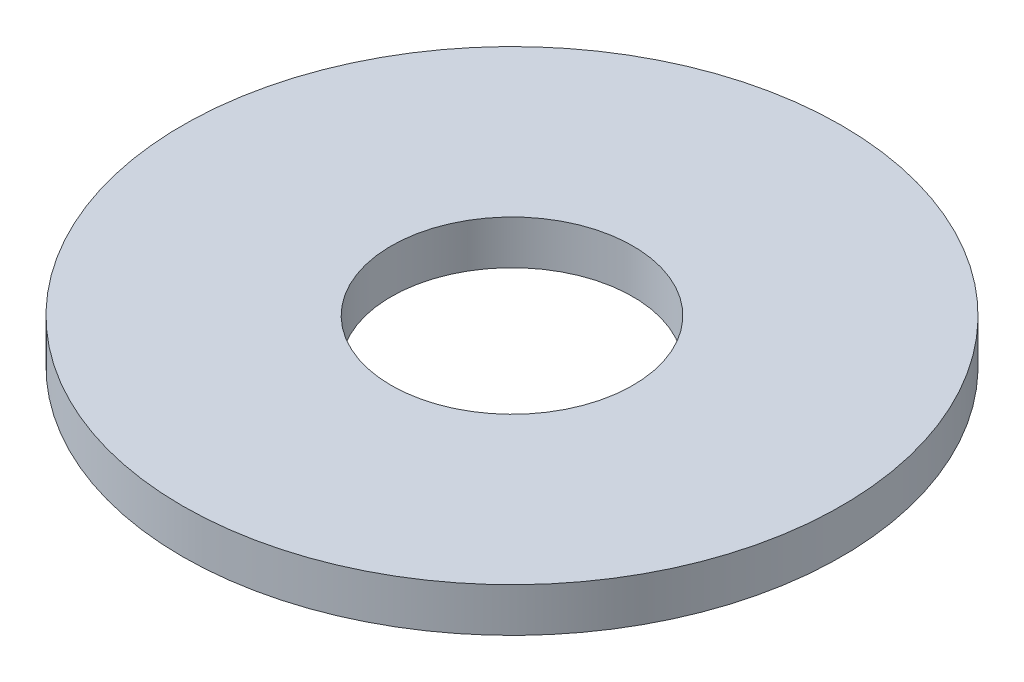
from build123d import *

# Parameters (mm, degrees)
ESQUISSE1_R          = 15
ESQUISSE1_R_2        = 5.5
BASE_EXTRUSION_DEPTH = 2


with BuildPart() as part:
    # Esquisse1 → Base-Extrusion (new body)
    with BuildSketch(Plane(origin=(0, 0, 0), x_dir=(1, 0, 0), z_dir=(0, 1, 0))):
        with Locations(Location((0, 0, 0), (0, 0, 270))):
            Circle(ESQUISSE1_R)
        with Locations(Location((0, 0, 0), (0, 0, 270))):
            Circle(ESQUISSE1_R_2, mode=Mode.SUBTRACT)
    extrude(amount=BASE_EXTRUSION_DEPTH)


solid = part.part
